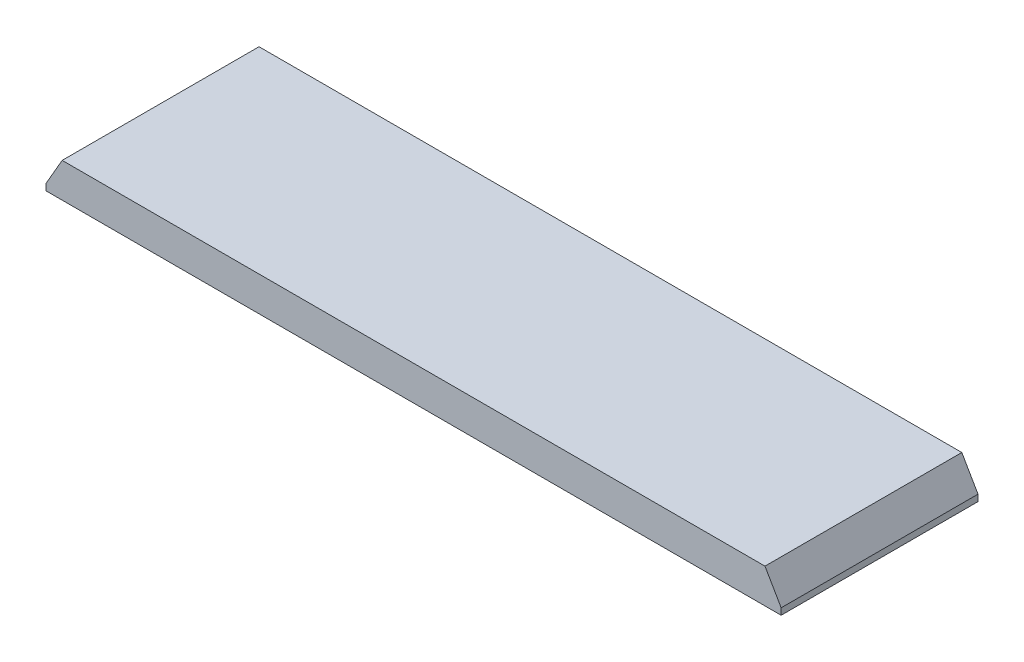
ISO-10303-21;
HEADER;
FILE_DESCRIPTION(('STEP AP214'),'2;1');
FILE_NAME('part.step','',(''),(''),'','','');
FILE_SCHEMA(('AUTOMOTIVE_DESIGN { 1 0 10303 214 1 1 1 1 }'));
ENDSEC;
DATA;
#1=APPLICATION_CONTEXT('core data for automotive mechanical design processes');
#2=APPLICATION_PROTOCOL_DEFINITION('international standard','automotive_design',2000,#1);
#3=PRODUCT_CONTEXT('',#1,'mechanical');
#4=PRODUCT('Part','Part','',(#3));
#5=PRODUCT_RELATED_PRODUCT_CATEGORY('part','',(#4));
#6=PRODUCT_DEFINITION_FORMATION('','',#4);
#7=PRODUCT_DEFINITION_CONTEXT('part definition',#1,'design');
#8=PRODUCT_DEFINITION('design','',#6,#7);
#9=PRODUCT_DEFINITION_SHAPE('','',#8);
#10=(LENGTH_UNIT() NAMED_UNIT(*) SI_UNIT(.MILLI.,.METRE.));
#11=(NAMED_UNIT(*) PLANE_ANGLE_UNIT() SI_UNIT($,.RADIAN.));
#12=(NAMED_UNIT(*) SI_UNIT($,.STERADIAN.) SOLID_ANGLE_UNIT());
#13=UNCERTAINTY_MEASURE_WITH_UNIT(LENGTH_MEASURE(1.E-05),#10,'distance_accuracy_value','');
#14=(GEOMETRIC_REPRESENTATION_CONTEXT(3) GLOBAL_UNCERTAINTY_ASSIGNED_CONTEXT((#13)) GLOBAL_UNIT_ASSIGNED_CONTEXT((#10,
#11,#12)) REPRESENTATION_CONTEXT('',''));
#15=CARTESIAN_POINT('',(0.,0.,0.));
#16=DIRECTION('',(0.,0.,1.));
#17=DIRECTION('',(1.,0.,0.));
#18=AXIS2_PLACEMENT_3D('',#15,#16,#17);
#19=CARTESIAN_POINT('',(541.5415,50.8,145.));
#20=DIRECTION('',(-1.,0.,0.));
#21=DIRECTION('',(0.,0.,1.));
#22=AXIS2_PLACEMENT_3D('',#19,#20,#21);
#23=PLANE('',#22);
#24=DIRECTION('',(0.,-1.,0.));
#25=VECTOR('',#24,1.);
#26=CARTESIAN_POINT('',(541.5415,50.8,-145.));
#27=LINE('',#26,#25);
#28=CARTESIAN_POINT('',(541.5415,9.52499999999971,-145.));
#29=VERTEX_POINT('',#28);
#30=CARTESIAN_POINT('',(541.5415,0.,-145.));
#31=VERTEX_POINT('',#30);
#32=EDGE_CURVE('E99',#29,#31,#27,.T.);
#33=ORIENTED_EDGE('',*,*,#32,.F.);
#34=DIRECTION('',(0.,0.,1.));
#35=VECTOR('',#34,1.);
#36=CARTESIAN_POINT('',(541.5415,9.52499999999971,145.));
#37=LINE('',#36,#35);
#38=CARTESIAN_POINT('',(541.5415,9.52499999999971,145.));
#39=VERTEX_POINT('',#38);
#40=EDGE_CURVE('E11',#29,#39,#37,.T.);
#41=ORIENTED_EDGE('',*,*,#40,.T.);
#42=DIRECTION('',(0.,-1.,0.));
#43=VECTOR('',#42,1.);
#44=CARTESIAN_POINT('',(541.5415,50.8,145.));
#45=LINE('',#44,#43);
#46=CARTESIAN_POINT('',(541.5415,0.,145.));
#47=VERTEX_POINT('',#46);
#48=EDGE_CURVE('E125',#39,#47,#45,.T.);
#49=ORIENTED_EDGE('',*,*,#48,.T.);
#50=DIRECTION('',(0.,0.,-1.));
#51=VECTOR('',#50,1.);
#52=CARTESIAN_POINT('',(541.5415,0.,145.));
#53=LINE('',#52,#51);
#54=EDGE_CURVE('E116',#47,#31,#53,.T.);
#55=ORIENTED_EDGE('',*,*,#54,.T.);
#56=EDGE_LOOP('',(#33,#41,#49,#55));
#57=FACE_BOUND('',#56,.T.);
#58=ADVANCED_FACE('F50',(#57),#23,.F.);
#59=CARTESIAN_POINT('',(541.5415,50.8,-145.));
#60=DIRECTION('',(0.,0.,1.));
#61=DIRECTION('',(1.,0.,0.));
#62=AXIS2_PLACEMENT_3D('',#59,#60,#61);
#63=PLANE('',#62);
#64=DIRECTION('',(0.,-1.,0.));
#65=VECTOR('',#64,1.);
#66=CARTESIAN_POINT('',(-541.5415,50.8,-145.));
#67=LINE('',#66,#65);
#68=CARTESIAN_POINT('',(-541.5415,9.52499999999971,-145.));
#69=VERTEX_POINT('',#68);
#70=CARTESIAN_POINT('',(-541.5415,0.,-145.));
#71=VERTEX_POINT('',#70);
#72=EDGE_CURVE('E109',#69,#71,#67,.T.);
#73=ORIENTED_EDGE('',*,*,#72,.F.);
#74=DIRECTION('',(0.499999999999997,0.86602540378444,0.));
#75=VECTOR('',#74,1.);
#76=CARTESIAN_POINT('',(-517.711367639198,50.8,-145.));
#77=LINE('',#76,#75);
#78=CARTESIAN_POINT('',(-517.711367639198,50.8,-145.));
#79=VERTEX_POINT('',#78);
#80=EDGE_CURVE('E60',#69,#79,#77,.T.);
#81=ORIENTED_EDGE('',*,*,#80,.T.);
#82=DIRECTION('',(-1.,0.,0.));
#83=VECTOR('',#82,1.);
#84=CARTESIAN_POINT('',(541.5415,50.8,-145.));
#85=LINE('',#84,#83);
#86=CARTESIAN_POINT('',(517.711367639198,50.8,-145.));
#87=VERTEX_POINT('',#86);
#88=EDGE_CURVE('E134',#87,#79,#85,.T.);
#89=ORIENTED_EDGE('',*,*,#88,.F.);
#90=DIRECTION('',(0.499999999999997,-0.86602540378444,0.));
#91=VECTOR('',#90,1.);
#92=CARTESIAN_POINT('',(517.711367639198,50.8,-145.));
#93=LINE('',#92,#91);
#94=EDGE_CURVE('E61',#87,#29,#93,.T.);
#95=ORIENTED_EDGE('',*,*,#94,.T.);
#96=ORIENTED_EDGE('',*,*,#32,.T.);
#97=DIRECTION('',(-1.,0.,0.));
#98=VECTOR('',#97,1.);
#99=CARTESIAN_POINT('',(541.5415,0.,-145.));
#100=LINE('',#99,#98);
#101=EDGE_CURVE('E101',#31,#71,#100,.T.);
#102=ORIENTED_EDGE('',*,*,#101,.T.);
#103=EDGE_LOOP('',(#73,#81,#89,#95,#96,#102));
#104=FACE_BOUND('',#103,.T.);
#105=ADVANCED_FACE('F105',(#104),#63,.F.);
#106=CARTESIAN_POINT('',(-541.5415,50.8,145.));
#107=DIRECTION('',(1.,0.,0.));
#108=DIRECTION('',(0.,0.,-1.));
#109=AXIS2_PLACEMENT_3D('',#106,#107,#108);
#110=PLANE('',#109);
#111=DIRECTION('',(0.,-1.,0.));
#112=VECTOR('',#111,1.);
#113=CARTESIAN_POINT('',(-541.5415,50.8,145.));
#114=LINE('',#113,#112);
#115=CARTESIAN_POINT('',(-541.5415,9.52499999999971,145.));
#116=VERTEX_POINT('',#115);
#117=CARTESIAN_POINT('',(-541.5415,0.,145.));
#118=VERTEX_POINT('',#117);
#119=EDGE_CURVE('E139',#116,#118,#114,.T.);
#120=ORIENTED_EDGE('',*,*,#119,.F.);
#121=DIRECTION('',(0.,0.,-1.));
#122=VECTOR('',#121,1.);
#123=CARTESIAN_POINT('',(-541.5415,9.52499999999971,-145.));
#124=LINE('',#123,#122);
#125=EDGE_CURVE('E75',#116,#69,#124,.T.);
#126=ORIENTED_EDGE('',*,*,#125,.T.);
#127=ORIENTED_EDGE('',*,*,#72,.T.);
#128=DIRECTION('',(0.,0.,1.));
#129=VECTOR('',#128,1.);
#130=CARTESIAN_POINT('',(-541.5415,0.,145.));
#131=LINE('',#130,#129);
#132=EDGE_CURVE('E117',#71,#118,#131,.T.);
#133=ORIENTED_EDGE('',*,*,#132,.T.);
#134=EDGE_LOOP('',(#120,#126,#127,#133));
#135=FACE_BOUND('',#134,.T.);
#136=ADVANCED_FACE('F173',(#135),#110,.F.);
#137=CARTESIAN_POINT('',(541.5415,50.8,145.));
#138=DIRECTION('',(0.,0.,-1.));
#139=DIRECTION('',(-1.,0.,0.));
#140=AXIS2_PLACEMENT_3D('',#137,#138,#139);
#141=PLANE('',#140);
#142=DIRECTION('',(1.,0.,0.));
#143=VECTOR('',#142,1.);
#144=CARTESIAN_POINT('',(541.5415,50.8,145.));
#145=LINE('',#144,#143);
#146=CARTESIAN_POINT('',(-517.711367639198,50.8,145.));
#147=VERTEX_POINT('',#146);
#148=CARTESIAN_POINT('',(517.711367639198,50.8,145.));
#149=VERTEX_POINT('',#148);
#150=EDGE_CURVE('E130',#147,#149,#145,.T.);
#151=ORIENTED_EDGE('',*,*,#150,.F.);
#152=DIRECTION('',(-0.499999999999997,-0.86602540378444,0.));
#153=VECTOR('',#152,1.);
#154=CARTESIAN_POINT('',(-517.711367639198,50.8,145.));
#155=LINE('',#154,#153);
#156=EDGE_CURVE('E153',#147,#116,#155,.T.);
#157=ORIENTED_EDGE('',*,*,#156,.T.);
#158=ORIENTED_EDGE('',*,*,#119,.T.);
#159=DIRECTION('',(1.,0.,0.));
#160=VECTOR('',#159,1.);
#161=CARTESIAN_POINT('',(541.5415,0.,145.));
#162=LINE('',#161,#160);
#163=EDGE_CURVE('E135',#118,#47,#162,.T.);
#164=ORIENTED_EDGE('',*,*,#163,.T.);
#165=ORIENTED_EDGE('',*,*,#48,.F.);
#166=DIRECTION('',(-0.499999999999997,0.86602540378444,0.));
#167=VECTOR('',#166,1.);
#168=CARTESIAN_POINT('',(517.711367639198,50.8,145.));
#169=LINE('',#168,#167);
#170=EDGE_CURVE('E148',#39,#149,#169,.T.);
#171=ORIENTED_EDGE('',*,*,#170,.T.);
#172=EDGE_LOOP('',(#151,#157,#158,#164,#165,#171));
#173=FACE_BOUND('',#172,.T.);
#174=ADVANCED_FACE('F175',(#173),#141,.F.);
#175=CARTESIAN_POINT('',(0.,50.8,0.));
#176=DIRECTION('',(0.,1.,0.));
#177=DIRECTION('',(0.,0.,1.));
#178=AXIS2_PLACEMENT_3D('',#175,#176,#177);
#179=PLANE('',#178);
#180=ORIENTED_EDGE('',*,*,#88,.T.);
#181=DIRECTION('',(0.,0.,1.));
#182=VECTOR('',#181,1.);
#183=CARTESIAN_POINT('',(-517.711367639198,50.8,145.));
#184=LINE('',#183,#182);
#185=EDGE_CURVE('E147',#79,#147,#184,.T.);
#186=ORIENTED_EDGE('',*,*,#185,.T.);
#187=ORIENTED_EDGE('',*,*,#150,.T.);
#188=DIRECTION('',(0.,0.,-1.));
#189=VECTOR('',#188,1.);
#190=CARTESIAN_POINT('',(517.711367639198,50.8,-145.));
#191=LINE('',#190,#189);
#192=EDGE_CURVE('E107',#149,#87,#191,.T.);
#193=ORIENTED_EDGE('',*,*,#192,.T.);
#194=EDGE_LOOP('',(#180,#186,#187,#193));
#195=FACE_BOUND('',#194,.T.);
#196=ADVANCED_FACE('F164',(#195),#179,.T.);
#197=CARTESIAN_POINT('',(0.,0.,0.));
#198=DIRECTION('',(0.,1.,0.));
#199=DIRECTION('',(0.,0.,1.));
#200=AXIS2_PLACEMENT_3D('',#197,#198,#199);
#201=PLANE('',#200);
#202=ORIENTED_EDGE('',*,*,#54,.F.);
#203=ORIENTED_EDGE('',*,*,#163,.F.);
#204=ORIENTED_EDGE('',*,*,#132,.F.);
#205=ORIENTED_EDGE('',*,*,#101,.F.);
#206=EDGE_LOOP('',(#202,#203,#204,#205));
#207=FACE_BOUND('',#206,.T.);
#208=ADVANCED_FACE('F112',(#207),#201,.F.);
#209=CARTESIAN_POINT('',(-517.711367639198,50.8,0.));
#210=DIRECTION('',(-0.86602540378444,0.499999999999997,0.));
#211=DIRECTION('',(0.,0.,-1.));
#212=AXIS2_PLACEMENT_3D('',#209,#210,#211);
#213=PLANE('',#212);
#214=ORIENTED_EDGE('',*,*,#80,.F.);
#215=ORIENTED_EDGE('',*,*,#125,.F.);
#216=ORIENTED_EDGE('',*,*,#156,.F.);
#217=ORIENTED_EDGE('',*,*,#185,.F.);
#218=EDGE_LOOP('',(#214,#215,#216,#217));
#219=FACE_BOUND('',#218,.T.);
#220=ADVANCED_FACE('F167',(#219),#213,.T.);
#221=CARTESIAN_POINT('',(517.711367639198,50.8,0.));
#222=DIRECTION('',(0.86602540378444,0.499999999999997,0.));
#223=DIRECTION('',(0.,0.,1.));
#224=AXIS2_PLACEMENT_3D('',#221,#222,#223);
#225=PLANE('',#224);
#226=ORIENTED_EDGE('',*,*,#170,.F.);
#227=ORIENTED_EDGE('',*,*,#40,.F.);
#228=ORIENTED_EDGE('',*,*,#94,.F.);
#229=ORIENTED_EDGE('',*,*,#192,.F.);
#230=EDGE_LOOP('',(#226,#227,#228,#229));
#231=FACE_BOUND('',#230,.T.);
#232=ADVANCED_FACE('F49',(#231),#225,.T.);
#233=CLOSED_SHELL('',(#58,#105,#136,#174,#196,#208,#220,#232));
#234=MANIFOLD_SOLID_BREP('B2',#233);
#235=ADVANCED_BREP_SHAPE_REPRESENTATION('',(#18,#234),#14);
#236=SHAPE_DEFINITION_REPRESENTATION(#9,#235);
ENDSEC;
END-ISO-10303-21;
